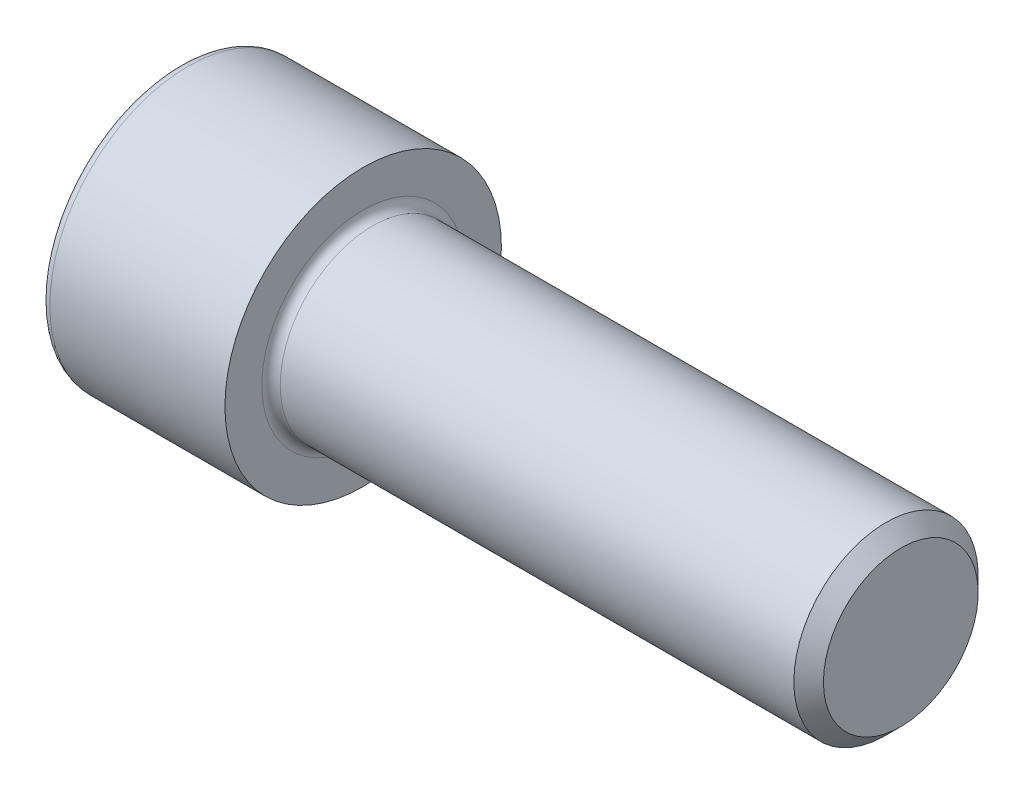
ISO-10303-21;
HEADER;
FILE_DESCRIPTION(('STEP AP214'),'2;1');
FILE_NAME('part.step','',(''),(''),'','','');
FILE_SCHEMA(('AUTOMOTIVE_DESIGN { 1 0 10303 214 1 1 1 1 }'));
ENDSEC;
DATA;
#1=APPLICATION_CONTEXT('core data for automotive mechanical design processes');
#2=APPLICATION_PROTOCOL_DEFINITION('international standard','automotive_design',2000,#1);
#3=PRODUCT_CONTEXT('',#1,'mechanical');
#4=PRODUCT('Part','Part','',(#3));
#5=PRODUCT_RELATED_PRODUCT_CATEGORY('part','',(#4));
#6=PRODUCT_DEFINITION_FORMATION('','',#4);
#7=PRODUCT_DEFINITION_CONTEXT('part definition',#1,'design');
#8=PRODUCT_DEFINITION('design','',#6,#7);
#9=PRODUCT_DEFINITION_SHAPE('','',#8);
#10=(LENGTH_UNIT() NAMED_UNIT(*) SI_UNIT(.MILLI.,.METRE.));
#11=(NAMED_UNIT(*) PLANE_ANGLE_UNIT() SI_UNIT($,.RADIAN.));
#12=(NAMED_UNIT(*) SI_UNIT($,.STERADIAN.) SOLID_ANGLE_UNIT());
#13=UNCERTAINTY_MEASURE_WITH_UNIT(LENGTH_MEASURE(1.E-05),#10,'distance_accuracy_value','');
#14=(GEOMETRIC_REPRESENTATION_CONTEXT(3) GLOBAL_UNCERTAINTY_ASSIGNED_CONTEXT((#13)) GLOBAL_UNIT_ASSIGNED_CONTEXT((#10,
#11,#12)) REPRESENTATION_CONTEXT('',''));
#15=CARTESIAN_POINT('',(0.,0.,0.));
#16=DIRECTION('',(0.,0.,1.));
#17=DIRECTION('',(1.,0.,0.));
#18=AXIS2_PLACEMENT_3D('',#15,#16,#17);
#19=CARTESIAN_POINT('',(0.,0.,0.));
#20=DIRECTION('',(-1.,0.,0.));
#21=DIRECTION('',(0.,0.,1.));
#22=AXIS2_PLACEMENT_3D('',#19,#20,#21);
#23=PLANE('',#22);
#24=DIRECTION('',(0.,-0.5,0.86602540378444));
#25=VECTOR('',#24,1.);
#26=CARTESIAN_POINT('',(0.,5.83989797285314,0.));
#27=LINE('',#26,#25);
#28=CARTESIAN_POINT('',(0.,5.83989797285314,0.));
#29=VERTEX_POINT('',#28);
#30=CARTESIAN_POINT('',(0.,2.91994898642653,5.05749999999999));
#31=VERTEX_POINT('',#30);
#32=EDGE_CURVE('E394',#29,#31,#27,.T.);
#33=ORIENTED_EDGE('',*,*,#32,.T.);
#34=DIRECTION('',(0.,1.,0.));
#35=VECTOR('',#34,1.);
#36=CARTESIAN_POINT('',(0.,-2.91994898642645,5.05749999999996));
#37=LINE('',#36,#35);
#38=CARTESIAN_POINT('',(0.,-2.91994898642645,5.05749999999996));
#39=VERTEX_POINT('',#38);
#40=EDGE_CURVE('E138',#39,#31,#37,.T.);
#41=ORIENTED_EDGE('',*,*,#40,.F.);
#42=DIRECTION('',(0.,-0.500000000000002,-0.866025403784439));
#43=VECTOR('',#42,1.);
#44=CARTESIAN_POINT('',(0.,-2.91994898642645,5.05749999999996));
#45=LINE('',#44,#43);
#46=CARTESIAN_POINT('',(0.,-5.839897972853,0.));
#47=VERTEX_POINT('',#46);
#48=EDGE_CURVE('E397',#39,#47,#45,.T.);
#49=ORIENTED_EDGE('',*,*,#48,.T.);
#50=DIRECTION('',(0.,0.5,-0.86602540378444));
#51=VECTOR('',#50,1.);
#52=CARTESIAN_POINT('',(0.,-5.839897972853,0.));
#53=LINE('',#52,#51);
#54=CARTESIAN_POINT('',(0.,-2.91994898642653,-5.05750000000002));
#55=VERTEX_POINT('',#54);
#56=EDGE_CURVE('E400',#47,#55,#53,.T.);
#57=ORIENTED_EDGE('',*,*,#56,.T.);
#58=DIRECTION('',(0.,-1.,0.));
#59=VECTOR('',#58,1.);
#60=CARTESIAN_POINT('',(0.,2.91994898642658,-5.05750000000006));
#61=LINE('',#60,#59);
#62=CARTESIAN_POINT('',(0.,2.91994898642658,-5.05750000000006));
#63=VERTEX_POINT('',#62);
#64=EDGE_CURVE('E403',#63,#55,#61,.T.);
#65=ORIENTED_EDGE('',*,*,#64,.F.);
#66=DIRECTION('',(0.,-0.500000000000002,-0.866025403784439));
#67=VECTOR('',#66,1.);
#68=CARTESIAN_POINT('',(0.,5.83989797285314,0.));
#69=LINE('',#68,#67);
#70=EDGE_CURVE('E133',#29,#63,#69,.T.);
#71=ORIENTED_EDGE('',*,*,#70,.F.);
#72=EDGE_LOOP('',(#33,#41,#49,#57,#65,#71));
#73=FACE_BOUND('',#72,.T.);
#74=CARTESIAN_POINT('',(0.,0.,0.));
#75=DIRECTION('',(-1.,0.,0.));
#76=DIRECTION('',(0.,0.,1.));
#77=AXIS2_PLACEMENT_3D('',#74,#75,#76);
#78=CIRCLE('',#77,8.4);
#79=CARTESIAN_POINT('',(0.,0.,8.40000000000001));
#80=VERTEX_POINT('',#79);
#81=EDGE_CURVE('E50',#80,#80,#78,.T.);
#82=ORIENTED_EDGE('',*,*,#81,.T.);
#83=EDGE_LOOP('',(#82));
#84=FACE_BOUND('',#83,.T.);
#85=ADVANCED_FACE('F42',(#73,#84),#23,.T.);
#86=CARTESIAN_POINT('',(47.,5.03600000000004,0.));
#87=DIRECTION('',(1.,0.,0.));
#88=DIRECTION('',(0.,0.,-1.));
#89=AXIS2_PLACEMENT_3D('',#86,#87,#88);
#90=PLANE('',#89);
#91=CARTESIAN_POINT('',(47.,0.,0.));
#92=DIRECTION('',(-1.,0.,0.));
#93=DIRECTION('',(0.,0.,1.));
#94=AXIS2_PLACEMENT_3D('',#91,#92,#93);
#95=CIRCLE('',#94,5.036);
#96=CARTESIAN_POINT('',(47.,0.,5.03599999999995));
#97=VERTEX_POINT('',#96);
#98=EDGE_CURVE('E156',#97,#97,#95,.T.);
#99=ORIENTED_EDGE('',*,*,#98,.F.);
#100=EDGE_LOOP('',(#99));
#101=FACE_BOUND('',#100,.T.);
#102=ADVANCED_FACE('F180',(#101),#90,.T.);
#103=CARTESIAN_POINT('',(47.,0.,0.));
#104=DIRECTION('',(-1.,0.,0.));
#105=DIRECTION('',(0.,0.,1.));
#106=AXIS2_PLACEMENT_3D('',#103,#104,#105);
#107=CONICAL_SURFACE('',#106,5.036,0.785398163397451);
#108=CARTESIAN_POINT('',(46.036,0.,0.));
#109=DIRECTION('',(-1.,0.,0.));
#110=DIRECTION('',(0.,0.,1.));
#111=AXIS2_PLACEMENT_3D('',#108,#109,#110);
#112=CIRCLE('',#111,6.);
#113=CARTESIAN_POINT('',(46.036,0.,5.99999999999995));
#114=VERTEX_POINT('',#113);
#115=EDGE_CURVE('E153',#114,#114,#112,.T.);
#116=ORIENTED_EDGE('',*,*,#115,.F.);
#117=EDGE_LOOP('',(#116));
#118=FACE_BOUND('',#117,.T.);
#119=ORIENTED_EDGE('',*,*,#98,.T.);
#120=EDGE_LOOP('',(#119));
#121=FACE_BOUND('',#120,.T.);
#122=ADVANCED_FACE('F186',(#118,#121),#107,.T.);
#123=CARTESIAN_POINT('',(-31.75,0.,0.));
#124=DIRECTION('',(-1.,0.,0.));
#125=DIRECTION('',(0.,0.,1.));
#126=AXIS2_PLACEMENT_3D('',#123,#124,#125);
#127=CYLINDRICAL_SURFACE('',#126,6.);
#128=CARTESIAN_POINT('',(12.6,0.,0.));
#129=DIRECTION('',(1.,0.,0.));
#130=DIRECTION('',(0.,0.,-1.));
#131=AXIS2_PLACEMENT_3D('',#128,#129,#130);
#132=CIRCLE('',#131,6.);
#133=CARTESIAN_POINT('',(12.6,0.,-6.00000000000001));
#134=VERTEX_POINT('',#133);
#135=EDGE_CURVE('E162',#134,#134,#132,.T.);
#136=ORIENTED_EDGE('',*,*,#135,.T.);
#137=EDGE_LOOP('',(#136));
#138=FACE_BOUND('',#137,.T.);
#139=ORIENTED_EDGE('',*,*,#115,.T.);
#140=EDGE_LOOP('',(#139));
#141=FACE_BOUND('',#140,.T.);
#142=ADVANCED_FACE('F198',(#138,#141),#127,.T.);
#143=CARTESIAN_POINT('',(11.9999999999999,9.00000000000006,0.));
#144=DIRECTION('',(1.,0.,0.));
#145=DIRECTION('',(0.,0.,-1.));
#146=AXIS2_PLACEMENT_3D('',#143,#144,#145);
#147=PLANE('',#146);
#148=CARTESIAN_POINT('',(12.,0.,0.));
#149=DIRECTION('',(1.,0.,0.));
#150=DIRECTION('',(0.,0.,-1.));
#151=AXIS2_PLACEMENT_3D('',#148,#149,#150);
#152=CIRCLE('',#151,6.6);
#153=CARTESIAN_POINT('',(12.,0.,-6.6));
#154=VERTEX_POINT('',#153);
#155=EDGE_CURVE('E159',#154,#154,#152,.F.);
#156=ORIENTED_EDGE('',*,*,#155,.T.);
#157=EDGE_LOOP('',(#156));
#158=FACE_BOUND('',#157,.T.);
#159=CARTESIAN_POINT('',(12.,0.,0.));
#160=DIRECTION('',(-1.,0.,0.));
#161=DIRECTION('',(0.,0.,1.));
#162=AXIS2_PLACEMENT_3D('',#159,#160,#161);
#163=CIRCLE('',#162,9.);
#164=CARTESIAN_POINT('',(12.,0.,9.00000000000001));
#165=VERTEX_POINT('',#164);
#166=EDGE_CURVE('E149',#165,#165,#163,.T.);
#167=ORIENTED_EDGE('',*,*,#166,.F.);
#168=EDGE_LOOP('',(#167));
#169=FACE_BOUND('',#168,.T.);
#170=ADVANCED_FACE('F194',(#158,#169),#147,.T.);
#171=CARTESIAN_POINT('',(-31.75,0.,0.));
#172=DIRECTION('',(-1.,0.,0.));
#173=DIRECTION('',(0.,0.,1.));
#174=AXIS2_PLACEMENT_3D('',#171,#172,#173);
#175=CYLINDRICAL_SURFACE('',#174,9.);
#176=CARTESIAN_POINT('',(0.600000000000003,0.,0.));
#177=DIRECTION('',(-1.,0.,0.));
#178=DIRECTION('',(0.,0.,1.));
#179=AXIS2_PLACEMENT_3D('',#176,#177,#178);
#180=CIRCLE('',#179,9.);
#181=CARTESIAN_POINT('',(0.600000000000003,0.,9.00000000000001));
#182=VERTEX_POINT('',#181);
#183=EDGE_CURVE('E13',#182,#182,#180,.F.);
#184=ORIENTED_EDGE('',*,*,#183,.T.);
#185=EDGE_LOOP('',(#184));
#186=FACE_BOUND('',#185,.T.);
#187=ORIENTED_EDGE('',*,*,#166,.T.);
#188=EDGE_LOOP('',(#187));
#189=FACE_BOUND('',#188,.T.);
#190=ADVANCED_FACE('F176',(#186,#189),#175,.T.);
#191=CARTESIAN_POINT('',(12.6,0.,0.));
#192=DIRECTION('',(1.,0.,0.));
#193=DIRECTION('',(0.,0.,-1.));
#194=AXIS2_PLACEMENT_3D('',#191,#192,#193);
#195=TOROIDAL_SURFACE('',#194,6.6,0.6);
#196=ORIENTED_EDGE('',*,*,#135,.F.);
#197=EDGE_LOOP('',(#196));
#198=FACE_BOUND('',#197,.T.);
#199=ORIENTED_EDGE('',*,*,#155,.F.);
#200=EDGE_LOOP('',(#199));
#201=FACE_BOUND('',#200,.T.);
#202=ADVANCED_FACE('F169',(#198,#201),#195,.F.);
#203=CARTESIAN_POINT('',(0.600000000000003,0.,0.));
#204=DIRECTION('',(-1.,0.,0.));
#205=DIRECTION('',(0.,0.,1.));
#206=AXIS2_PLACEMENT_3D('',#203,#204,#205);
#207=TOROIDAL_SURFACE('',#206,8.4,0.6);
#208=ORIENTED_EDGE('',*,*,#183,.F.);
#209=EDGE_LOOP('',(#208));
#210=FACE_BOUND('',#209,.T.);
#211=ORIENTED_EDGE('',*,*,#81,.F.);
#212=EDGE_LOOP('',(#211));
#213=FACE_BOUND('',#212,.T.);
#214=ADVANCED_FACE('F44',(#210,#213),#207,.T.);
#215=CARTESIAN_POINT('',(5.99999999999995,5.83989797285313,0.));
#216=DIRECTION('',(0.,-0.86602540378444,-0.5));
#217=DIRECTION('',(0.,0.5,-0.86602540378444));
#218=AXIS2_PLACEMENT_3D('',#215,#216,#217);
#219=PLANE('',#218);
#220=ORIENTED_EDGE('',*,*,#32,.F.);
#221=DIRECTION('',(-1.,0.,0.));
#222=VECTOR('',#221,1.);
#223=CARTESIAN_POINT('',(5.99999999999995,5.83989797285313,0.));
#224=LINE('',#223,#222);
#225=CARTESIAN_POINT('',(5.99999999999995,5.83989797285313,0.));
#226=VERTEX_POINT('',#225);
#227=EDGE_CURVE('E393',#226,#29,#224,.T.);
#228=ORIENTED_EDGE('',*,*,#227,.F.);
#229=DIRECTION('',(0.,-0.5,0.86602540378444));
#230=VECTOR('',#229,1.);
#231=CARTESIAN_POINT('',(5.99999999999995,5.83989797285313,0.));
#232=LINE('',#231,#230);
#233=CARTESIAN_POINT('',(6.00000000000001,4.37992347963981,2.52875));
#234=VERTEX_POINT('',#233);
#235=EDGE_CURVE('E125',#226,#234,#232,.T.);
#236=ORIENTED_EDGE('',*,*,#235,.T.);
#237=CARTESIAN_POINT('',(6.00000000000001,2.91994898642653,5.05749999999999));
#238=VERTEX_POINT('',#237);
#239=EDGE_CURVE('E116',#234,#238,#232,.T.);
#240=ORIENTED_EDGE('',*,*,#239,.T.);
#241=DIRECTION('',(-1.,0.,0.));
#242=VECTOR('',#241,1.);
#243=CARTESIAN_POINT('',(6.00000000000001,2.91994898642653,5.05749999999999));
#244=LINE('',#243,#242);
#245=EDGE_CURVE('E130',#238,#31,#244,.T.);
#246=ORIENTED_EDGE('',*,*,#245,.T.);
#247=EDGE_LOOP('',(#220,#228,#236,#240,#246));
#248=FACE_BOUND('',#247,.T.);
#249=ADVANCED_FACE('F129',(#248),#219,.T.);
#250=CARTESIAN_POINT('',(6.00000000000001,-2.9199489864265,5.05749999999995));
#251=DIRECTION('',(0.,0.,1.));
#252=DIRECTION('',(0.,-1.,0.));
#253=AXIS2_PLACEMENT_3D('',#250,#251,#252);
#254=PLANE('',#253);
#255=ORIENTED_EDGE('',*,*,#40,.T.);
#256=ORIENTED_EDGE('',*,*,#245,.F.);
#257=DIRECTION('',(0.,1.,0.));
#258=VECTOR('',#257,1.);
#259=CARTESIAN_POINT('',(6.00000000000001,-2.9199489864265,5.05749999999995));
#260=LINE('',#259,#258);
#261=CARTESIAN_POINT('',(6.00000000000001,0.,5.05749999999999));
#262=VERTEX_POINT('',#261);
#263=EDGE_CURVE('E113',#262,#238,#260,.T.);
#264=ORIENTED_EDGE('',*,*,#263,.F.);
#265=CARTESIAN_POINT('',(6.00000000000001,-2.9199489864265,5.05749999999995));
#266=VERTEX_POINT('',#265);
#267=EDGE_CURVE('E124',#266,#262,#260,.T.);
#268=ORIENTED_EDGE('',*,*,#267,.F.);
#269=DIRECTION('',(-1.,0.,0.));
#270=VECTOR('',#269,1.);
#271=CARTESIAN_POINT('',(6.00000000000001,-2.9199489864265,5.05749999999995));
#272=LINE('',#271,#270);
#273=EDGE_CURVE('E140',#266,#39,#272,.T.);
#274=ORIENTED_EDGE('',*,*,#273,.T.);
#275=EDGE_LOOP('',(#255,#256,#264,#268,#274));
#276=FACE_BOUND('',#275,.T.);
#277=ADVANCED_FACE('F135',(#276),#254,.F.);
#278=CARTESIAN_POINT('',(6.00000000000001,-2.9199489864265,5.05749999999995));
#279=DIRECTION('',(0.,0.866025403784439,-0.500000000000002));
#280=DIRECTION('',(0.,0.500000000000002,0.866025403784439));
#281=AXIS2_PLACEMENT_3D('',#278,#279,#280);
#282=PLANE('',#281);
#283=ORIENTED_EDGE('',*,*,#48,.F.);
#284=ORIENTED_EDGE('',*,*,#273,.F.);
#285=DIRECTION('',(0.,-0.500000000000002,-0.866025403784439));
#286=VECTOR('',#285,1.);
#287=CARTESIAN_POINT('',(6.00000000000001,-2.9199489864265,5.05749999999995));
#288=LINE('',#287,#286);
#289=CARTESIAN_POINT('',(6.00000000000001,-4.37992347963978,2.52874999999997));
#290=VERTEX_POINT('',#289);
#291=EDGE_CURVE('E374',#266,#290,#288,.T.);
#292=ORIENTED_EDGE('',*,*,#291,.T.);
#293=CARTESIAN_POINT('',(6.00000000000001,-5.83989797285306,0.));
#294=VERTEX_POINT('',#293);
#295=EDGE_CURVE('E376',#290,#294,#288,.T.);
#296=ORIENTED_EDGE('',*,*,#295,.T.);
#297=DIRECTION('',(-1.,0.,0.));
#298=VECTOR('',#297,1.);
#299=CARTESIAN_POINT('',(6.00000000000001,-5.83989797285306,0.));
#300=LINE('',#299,#298);
#301=EDGE_CURVE('E145',#294,#47,#300,.T.);
#302=ORIENTED_EDGE('',*,*,#301,.T.);
#303=EDGE_LOOP('',(#283,#284,#292,#296,#302));
#304=FACE_BOUND('',#303,.T.);
#305=ADVANCED_FACE('F250',(#304),#282,.T.);
#306=CARTESIAN_POINT('',(6.00000000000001,-5.83989797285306,0.));
#307=DIRECTION('',(0.,0.86602540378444,0.5));
#308=DIRECTION('',(0.,-0.5,0.86602540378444));
#309=AXIS2_PLACEMENT_3D('',#306,#307,#308);
#310=PLANE('',#309);
#311=ORIENTED_EDGE('',*,*,#56,.F.);
#312=ORIENTED_EDGE('',*,*,#301,.F.);
#313=DIRECTION('',(0.,0.5,-0.86602540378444));
#314=VECTOR('',#313,1.);
#315=CARTESIAN_POINT('',(6.00000000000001,-5.83989797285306,0.));
#316=LINE('',#315,#314);
#317=CARTESIAN_POINT('',(6.00000000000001,-4.37992347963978,-2.52875000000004));
#318=VERTEX_POINT('',#317);
#319=EDGE_CURVE('E379',#294,#318,#316,.T.);
#320=ORIENTED_EDGE('',*,*,#319,.T.);
#321=CARTESIAN_POINT('',(6.00000000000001,-2.91994898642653,-5.05750000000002));
#322=VERTEX_POINT('',#321);
#323=EDGE_CURVE('E383',#318,#322,#316,.T.);
#324=ORIENTED_EDGE('',*,*,#323,.T.);
#325=DIRECTION('',(-1.,0.,0.));
#326=VECTOR('',#325,1.);
#327=CARTESIAN_POINT('',(6.00000000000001,-2.91994898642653,-5.05750000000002));
#328=LINE('',#327,#326);
#329=EDGE_CURVE('E412',#322,#55,#328,.T.);
#330=ORIENTED_EDGE('',*,*,#329,.T.);
#331=EDGE_LOOP('',(#311,#312,#320,#324,#330));
#332=FACE_BOUND('',#331,.T.);
#333=ADVANCED_FACE('F259',(#332),#310,.T.);
#334=CARTESIAN_POINT('',(6.00000000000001,2.91994898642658,-5.05750000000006));
#335=DIRECTION('',(0.,0.,-1.));
#336=DIRECTION('',(0.,1.,0.));
#337=AXIS2_PLACEMENT_3D('',#334,#335,#336);
#338=PLANE('',#337);
#339=ORIENTED_EDGE('',*,*,#64,.T.);
#340=ORIENTED_EDGE('',*,*,#329,.F.);
#341=DIRECTION('',(0.,-1.,0.));
#342=VECTOR('',#341,1.);
#343=CARTESIAN_POINT('',(6.00000000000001,2.91994898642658,-5.05750000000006));
#344=LINE('',#343,#342);
#345=CARTESIAN_POINT('',(6.00000000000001,0.,-5.05750000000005));
#346=VERTEX_POINT('',#345);
#347=EDGE_CURVE('E387',#346,#322,#344,.T.);
#348=ORIENTED_EDGE('',*,*,#347,.F.);
#349=CARTESIAN_POINT('',(6.00000000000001,2.91994898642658,-5.05750000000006));
#350=VERTEX_POINT('',#349);
#351=EDGE_CURVE('E57',#350,#346,#344,.T.);
#352=ORIENTED_EDGE('',*,*,#351,.F.);
#353=DIRECTION('',(-1.,0.,0.));
#354=VECTOR('',#353,1.);
#355=CARTESIAN_POINT('',(6.00000000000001,2.91994898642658,-5.05750000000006));
#356=LINE('',#355,#354);
#357=EDGE_CURVE('E409',#350,#63,#356,.T.);
#358=ORIENTED_EDGE('',*,*,#357,.T.);
#359=EDGE_LOOP('',(#339,#340,#348,#352,#358));
#360=FACE_BOUND('',#359,.T.);
#361=ADVANCED_FACE('F269',(#360),#338,.F.);
#362=CARTESIAN_POINT('',(5.99999999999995,5.83989797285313,0.));
#363=DIRECTION('',(0.,0.866025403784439,-0.500000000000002));
#364=DIRECTION('',(0.,0.500000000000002,0.866025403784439));
#365=AXIS2_PLACEMENT_3D('',#362,#363,#364);
#366=PLANE('',#365);
#367=ORIENTED_EDGE('',*,*,#70,.T.);
#368=ORIENTED_EDGE('',*,*,#357,.F.);
#369=DIRECTION('',(0.,-0.500000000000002,-0.866025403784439));
#370=VECTOR('',#369,1.);
#371=CARTESIAN_POINT('',(5.99999999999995,5.83989797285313,0.));
#372=LINE('',#371,#370);
#373=CARTESIAN_POINT('',(6.00000000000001,4.37992347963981,-2.52875000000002));
#374=VERTEX_POINT('',#373);
#375=EDGE_CURVE('E389',#374,#350,#372,.T.);
#376=ORIENTED_EDGE('',*,*,#375,.F.);
#377=EDGE_CURVE('E390',#226,#374,#372,.T.);
#378=ORIENTED_EDGE('',*,*,#377,.F.);
#379=ORIENTED_EDGE('',*,*,#227,.T.);
#380=EDGE_LOOP('',(#367,#368,#376,#378,#379));
#381=FACE_BOUND('',#380,.T.);
#382=ADVANCED_FACE('F279',(#381),#366,.F.);
#383=CARTESIAN_POINT('',(5.99999999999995,5.83989797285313,0.));
#384=DIRECTION('',(1.,0.,0.));
#385=DIRECTION('',(0.,0.,-1.));
#386=AXIS2_PLACEMENT_3D('',#383,#384,#385);
#387=PLANE('',#386);
#388=ORIENTED_EDGE('',*,*,#347,.T.);
#389=ORIENTED_EDGE('',*,*,#323,.F.);
#390=CARTESIAN_POINT('',(6.00000000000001,0.,0.));
#391=DIRECTION('',(-1.,0.,0.));
#392=DIRECTION('',(0.,0.,1.));
#393=AXIS2_PLACEMENT_3D('',#390,#391,#392);
#394=CIRCLE('',#393,5.0575);
#395=EDGE_CURVE('E419',#346,#318,#394,.T.);
#396=ORIENTED_EDGE('',*,*,#395,.F.);
#397=EDGE_LOOP('',(#388,#389,#396));
#398=FACE_BOUND('',#397,.T.);
#399=ADVANCED_FACE('F289',(#398),#387,.F.);
#400=ORIENTED_EDGE('',*,*,#319,.F.);
#401=ORIENTED_EDGE('',*,*,#295,.F.);
#402=EDGE_CURVE('E143',#318,#290,#394,.T.);
#403=ORIENTED_EDGE('',*,*,#402,.F.);
#404=EDGE_LOOP('',(#400,#401,#403));
#405=FACE_BOUND('',#404,.T.);
#406=ADVANCED_FACE('F299',(#405),#387,.F.);
#407=ORIENTED_EDGE('',*,*,#291,.F.);
#408=ORIENTED_EDGE('',*,*,#267,.T.);
#409=EDGE_CURVE('E139',#290,#262,#394,.T.);
#410=ORIENTED_EDGE('',*,*,#409,.F.);
#411=EDGE_LOOP('',(#407,#408,#410));
#412=FACE_BOUND('',#411,.T.);
#413=ADVANCED_FACE('F310',(#412),#387,.F.);
#414=ORIENTED_EDGE('',*,*,#263,.T.);
#415=ORIENTED_EDGE('',*,*,#239,.F.);
#416=EDGE_CURVE('E119',#262,#234,#394,.T.);
#417=ORIENTED_EDGE('',*,*,#416,.F.);
#418=EDGE_LOOP('',(#414,#415,#417));
#419=FACE_BOUND('',#418,.T.);
#420=ADVANCED_FACE('F115',(#419),#387,.F.);
#421=ORIENTED_EDGE('',*,*,#235,.F.);
#422=ORIENTED_EDGE('',*,*,#377,.T.);
#423=EDGE_CURVE('E150',#234,#374,#394,.T.);
#424=ORIENTED_EDGE('',*,*,#423,.F.);
#425=EDGE_LOOP('',(#421,#422,#424));
#426=FACE_BOUND('',#425,.T.);
#427=ADVANCED_FACE('F327',(#426),#387,.F.);
#428=ORIENTED_EDGE('',*,*,#375,.T.);
#429=ORIENTED_EDGE('',*,*,#351,.T.);
#430=EDGE_CURVE('E418',#374,#346,#394,.T.);
#431=ORIENTED_EDGE('',*,*,#430,.F.);
#432=EDGE_LOOP('',(#428,#429,#431));
#433=FACE_BOUND('',#432,.T.);
#434=ADVANCED_FACE('F302',(#433),#387,.F.);
#435=CARTESIAN_POINT('',(6.00000000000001,0.,0.));
#436=DIRECTION('',(-1.,0.,0.));
#437=DIRECTION('',(0.,0.,1.));
#438=AXIS2_PLACEMENT_3D('',#435,#436,#437);
#439=CONICAL_SURFACE('',#438,5.0575,1.04719755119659);
#440=CARTESIAN_POINT('',(8.91994898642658,0.,0.));
#441=VERTEX_POINT('',#440);
#442=VERTEX_LOOP('',#441);
#443=FACE_BOUND('',#442,.T.);
#444=ORIENTED_EDGE('',*,*,#416,.T.);
#445=ORIENTED_EDGE('',*,*,#423,.T.);
#446=ORIENTED_EDGE('',*,*,#430,.T.);
#447=ORIENTED_EDGE('',*,*,#395,.T.);
#448=ORIENTED_EDGE('',*,*,#402,.T.);
#449=ORIENTED_EDGE('',*,*,#409,.T.);
#450=EDGE_LOOP('',(#444,#445,#446,#447,#448,#449));
#451=FACE_BOUND('',#450,.T.);
#452=ADVANCED_FACE('F191',(#443,#451),#439,.F.);
#453=CLOSED_SHELL('',(#85,#102,#122,#142,#170,#190,#202,#214,#249,#277,#305,#333,#361,#382,#399,
#406,#413,#420,#427,#434,#452));
#454=MANIFOLD_SOLID_BREP('B2',#453);
#455=ADVANCED_BREP_SHAPE_REPRESENTATION('',(#18,#454),#14);
#456=SHAPE_DEFINITION_REPRESENTATION(#9,#455);
ENDSEC;
END-ISO-10303-21;
